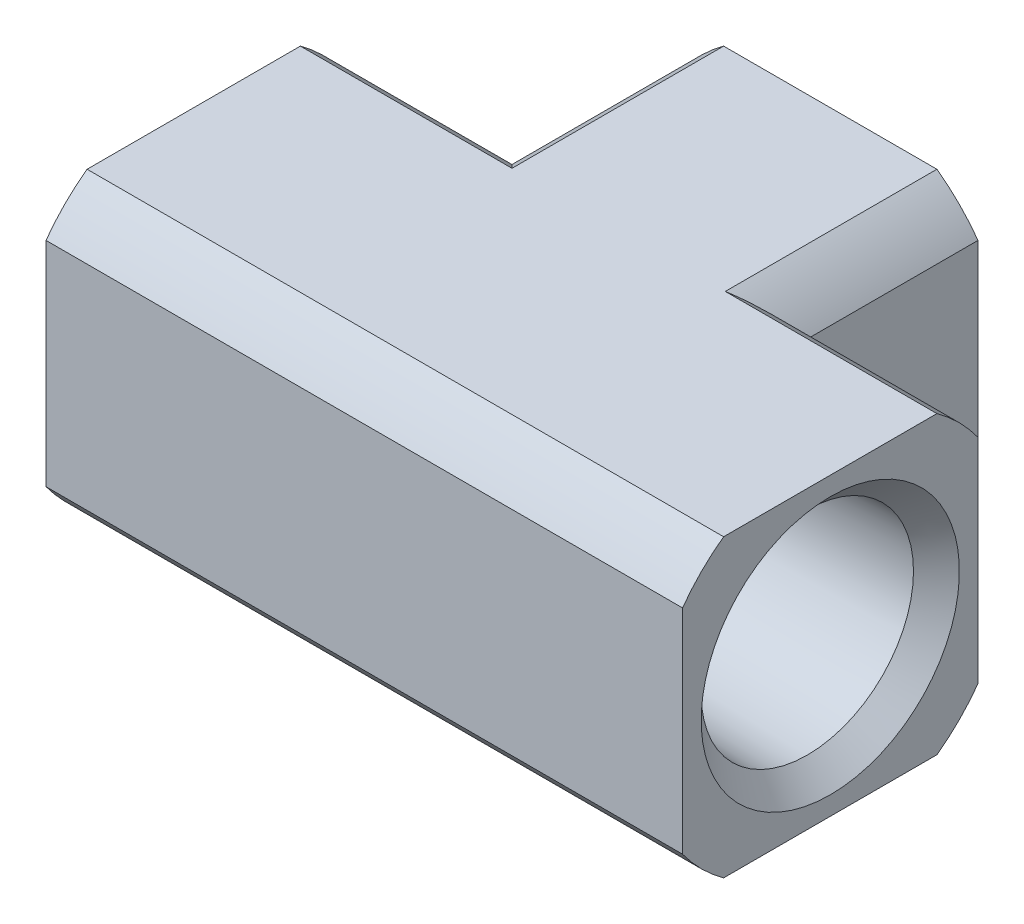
ISO-10303-21;
HEADER;
FILE_DESCRIPTION(('STEP AP214'),'2;1');
FILE_NAME('part.step','',(''),(''),'','','');
FILE_SCHEMA(('AUTOMOTIVE_DESIGN { 1 0 10303 214 1 1 1 1 }'));
ENDSEC;
DATA;
#1=APPLICATION_CONTEXT('core data for automotive mechanical design processes');
#2=APPLICATION_PROTOCOL_DEFINITION('international standard','automotive_design',2000,#1);
#3=PRODUCT_CONTEXT('',#1,'mechanical');
#4=PRODUCT('Part','Part','',(#3));
#5=PRODUCT_RELATED_PRODUCT_CATEGORY('part','',(#4));
#6=PRODUCT_DEFINITION_FORMATION('','',#4);
#7=PRODUCT_DEFINITION_CONTEXT('part definition',#1,'design');
#8=PRODUCT_DEFINITION('design','',#6,#7);
#9=PRODUCT_DEFINITION_SHAPE('','',#8);
#10=(LENGTH_UNIT() NAMED_UNIT(*) SI_UNIT(.MILLI.,.METRE.));
#11=(NAMED_UNIT(*) PLANE_ANGLE_UNIT() SI_UNIT($,.RADIAN.));
#12=(NAMED_UNIT(*) SI_UNIT($,.STERADIAN.) SOLID_ANGLE_UNIT());
#13=UNCERTAINTY_MEASURE_WITH_UNIT(LENGTH_MEASURE(1.E-05),#10,'distance_accuracy_value','');
#14=(GEOMETRIC_REPRESENTATION_CONTEXT(3) GLOBAL_UNCERTAINTY_ASSIGNED_CONTEXT((#13)) GLOBAL_UNIT_ASSIGNED_CONTEXT((#10,
#11,#12)) REPRESENTATION_CONTEXT('',''));
#15=CARTESIAN_POINT('',(0.,0.,0.));
#16=DIRECTION('',(0.,0.,1.));
#17=DIRECTION('',(1.,0.,0.));
#18=AXIS2_PLACEMENT_3D('',#15,#16,#17);
#19=CARTESIAN_POINT('',(3.81,0.,0.));
#20=DIRECTION('',(-1.,0.,0.));
#21=DIRECTION('',(0.,0.,1.));
#22=AXIS2_PLACEMENT_3D('',#19,#20,#21);
#23=CYLINDRICAL_SURFACE('',#22,4.1656);
#24=CARTESIAN_POINT('',(3.81,0.,0.));
#25=DIRECTION('',(-1.,0.,0.));
#26=DIRECTION('',(0.,0.,1.));
#27=AXIS2_PLACEMENT_3D('',#24,#25,#26);
#28=CIRCLE('',#27,4.1656);
#29=CARTESIAN_POINT('',(3.81,1.68407938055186,-3.81));
#30=VERTEX_POINT('',#29);
#31=CARTESIAN_POINT('',(3.81,-1.68407938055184,-3.81));
#32=VERTEX_POINT('',#31);
#33=EDGE_CURVE('E166',#30,#32,#28,.F.);
#34=ORIENTED_EDGE('',*,*,#33,.T.);
#35=CARTESIAN_POINT('',(0.,0.,0.));
#36=DIRECTION('',(-0.707106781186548,0.,-0.707106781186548));
#37=DIRECTION('',(-0.707106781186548,0.,0.707106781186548));
#38=AXIS2_PLACEMENT_3D('',#35,#36,#37);
#39=ELLIPSE('',#38,5.89104801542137,4.1656);
#40=CARTESIAN_POINT('',(0.,-4.1656,0.));
#41=VERTEX_POINT('',#40);
#42=EDGE_CURVE('E197',#32,#41,#39,.T.);
#43=ORIENTED_EDGE('',*,*,#42,.T.);
#44=CARTESIAN_POINT('',(0.,0.,0.));
#45=DIRECTION('',(-0.707106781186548,0.,0.707106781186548));
#46=DIRECTION('',(-0.707106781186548,0.,-0.707106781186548));
#47=AXIS2_PLACEMENT_3D('',#44,#45,#46);
#48=ELLIPSE('',#47,5.89104801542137,4.1656);
#49=CARTESIAN_POINT('',(-3.81,-1.68407938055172,-3.81));
#50=VERTEX_POINT('',#49);
#51=EDGE_CURVE('E161',#41,#50,#48,.F.);
#52=ORIENTED_EDGE('',*,*,#51,.T.);
#53=CARTESIAN_POINT('',(-3.81,0.,0.));
#54=DIRECTION('',(-1.,0.,0.));
#55=DIRECTION('',(0.,0.,1.));
#56=AXIS2_PLACEMENT_3D('',#53,#54,#55);
#57=CIRCLE('',#56,4.1656);
#58=CARTESIAN_POINT('',(-3.81,1.68407938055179,-3.81));
#59=VERTEX_POINT('',#58);
#60=EDGE_CURVE('E157',#50,#59,#57,.T.);
#61=ORIENTED_EDGE('',*,*,#60,.T.);
#62=CARTESIAN_POINT('',(0.,0.,0.));
#63=DIRECTION('',(-0.707106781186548,0.,0.707106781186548));
#64=DIRECTION('',(-0.707106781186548,0.,-0.707106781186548));
#65=AXIS2_PLACEMENT_3D('',#62,#63,#64);
#66=ELLIPSE('',#65,5.89104801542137,4.1656);
#67=CARTESIAN_POINT('',(0.,4.1656,0.));
#68=VERTEX_POINT('',#67);
#69=EDGE_CURVE('E20',#59,#68,#66,.F.);
#70=ORIENTED_EDGE('',*,*,#69,.T.);
#71=CARTESIAN_POINT('',(0.,0.,0.));
#72=DIRECTION('',(-0.707106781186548,0.,-0.707106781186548));
#73=DIRECTION('',(-0.707106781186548,0.,0.707106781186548));
#74=AXIS2_PLACEMENT_3D('',#71,#72,#73);
#75=ELLIPSE('',#74,5.89104801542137,4.1656);
#76=EDGE_CURVE('E175',#68,#30,#75,.T.);
#77=ORIENTED_EDGE('',*,*,#76,.T.);
#78=EDGE_LOOP('',(#34,#43,#52,#61,#70,#77));
#79=FACE_BOUND('',#78,.T.);
#80=ADVANCED_FACE('F16',(#79),#23,.F.);
#81=CARTESIAN_POINT('',(0.,0.,-3.81));
#82=DIRECTION('',(0.,0.,1.));
#83=DIRECTION('',(1.,0.,0.));
#84=AXIS2_PLACEMENT_3D('',#81,#82,#83);
#85=CYLINDRICAL_SURFACE('',#84,4.1656);
#86=ORIENTED_EDGE('',*,*,#76,.F.);
#87=ORIENTED_EDGE('',*,*,#69,.F.);
#88=CARTESIAN_POINT('',(0.,0.,-3.81));
#89=DIRECTION('',(0.,0.,1.));
#90=DIRECTION('',(1.,0.,0.));
#91=AXIS2_PLACEMENT_3D('',#88,#89,#90);
#92=CIRCLE('',#91,4.1656);
#93=EDGE_CURVE('E173',#59,#30,#92,.F.);
#94=ORIENTED_EDGE('',*,*,#93,.T.);
#95=EDGE_LOOP('',(#86,#87,#94));
#96=FACE_BOUND('',#95,.T.);
#97=ADVANCED_FACE('F171',(#96),#85,.F.);
#98=CARTESIAN_POINT('',(0.,0.,-3.81));
#99=DIRECTION('',(0.,0.,1.));
#100=DIRECTION('',(1.,0.,0.));
#101=AXIS2_PLACEMENT_3D('',#98,#99,#100);
#102=CYLINDRICAL_SURFACE('',#101,4.1656);
#103=ORIENTED_EDGE('',*,*,#51,.F.);
#104=ORIENTED_EDGE('',*,*,#42,.F.);
#105=CARTESIAN_POINT('',(0.,0.,-3.81));
#106=DIRECTION('',(0.,0.,1.));
#107=DIRECTION('',(1.,0.,0.));
#108=AXIS2_PLACEMENT_3D('',#105,#106,#107);
#109=CIRCLE('',#108,4.1656);
#110=EDGE_CURVE('E193',#32,#50,#109,.F.);
#111=ORIENTED_EDGE('',*,*,#110,.T.);
#112=EDGE_LOOP('',(#103,#104,#111));
#113=FACE_BOUND('',#112,.T.);
#114=ADVANCED_FACE('F212',(#113),#102,.F.);
#115=CARTESIAN_POINT('',(-3.81,0.,0.));
#116=DIRECTION('',(1.,0.,0.));
#117=DIRECTION('',(0.,0.,-1.));
#118=AXIS2_PLACEMENT_3D('',#115,#116,#117);
#119=PLANE('',#118);
#120=DIRECTION('',(0.,-1.,0.));
#121=VECTOR('',#120,1.);
#122=CARTESIAN_POINT('',(-3.81000000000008,-3.00779579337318,-3.81));
#123=LINE('',#122,#121);
#124=CARTESIAN_POINT('',(-3.81000000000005,-2.00487109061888,-3.81));
#125=VERTEX_POINT('',#124);
#126=EDGE_CURVE('E215',#50,#125,#123,.T.);
#127=ORIENTED_EDGE('',*,*,#126,.T.);
#128=CARTESIAN_POINT('',(-3.81,0.,0.));
#129=DIRECTION('',(1.,0.,0.));
#130=DIRECTION('',(0.,0.,-1.));
#131=AXIS2_PLACEMENT_3D('',#128,#129,#130);
#132=CIRCLE('',#131,4.3053);
#133=CARTESIAN_POINT('',(-3.81,2.00487109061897,-3.81));
#134=VERTEX_POINT('',#133);
#135=EDGE_CURVE('E179',#125,#134,#132,.F.);
#136=ORIENTED_EDGE('',*,*,#135,.T.);
#137=DIRECTION('',(0.,-1.,0.));
#138=VECTOR('',#137,1.);
#139=CARTESIAN_POINT('',(-3.81,3.00779579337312,-3.81));
#140=LINE('',#139,#138);
#141=EDGE_CURVE('E177',#134,#59,#140,.T.);
#142=ORIENTED_EDGE('',*,*,#141,.T.);
#143=ORIENTED_EDGE('',*,*,#60,.F.);
#144=EDGE_LOOP('',(#127,#136,#142,#143));
#145=FACE_BOUND('',#144,.T.);
#146=ADVANCED_FACE('F178',(#145),#119,.F.);
#147=CARTESIAN_POINT('',(3.81,-4.30529999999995,4.38645300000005));
#148=DIRECTION('',(-1.,0.,0.));
#149=DIRECTION('',(0.,1.,0.));
#150=AXIS2_PLACEMENT_3D('',#147,#148,#149);
#151=PLANE('',#150);
#152=ORIENTED_EDGE('',*,*,#33,.F.);
#153=DIRECTION('',(0.,1.,0.));
#154=VECTOR('',#153,1.);
#155=CARTESIAN_POINT('',(3.81,3.00779579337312,-3.81));
#156=LINE('',#155,#154);
#157=CARTESIAN_POINT('',(3.81000000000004,2.00487109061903,-3.80999999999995));
#158=VERTEX_POINT('',#157);
#159=EDGE_CURVE('E185',#30,#158,#156,.T.);
#160=ORIENTED_EDGE('',*,*,#159,.T.);
#161=CARTESIAN_POINT('',(3.81,0.,0.));
#162=DIRECTION('',(-1.,0.,0.));
#163=DIRECTION('',(0.,-1.,0.));
#164=AXIS2_PLACEMENT_3D('',#161,#162,#163);
#165=CIRCLE('',#164,4.3053);
#166=CARTESIAN_POINT('',(3.81,-2.00487109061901,-3.81));
#167=VERTEX_POINT('',#166);
#168=EDGE_CURVE('E204',#158,#167,#165,.F.);
#169=ORIENTED_EDGE('',*,*,#168,.T.);
#170=DIRECTION('',(0.,1.,0.));
#171=VECTOR('',#170,1.);
#172=CARTESIAN_POINT('',(3.81,-3.00779579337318,-3.81));
#173=LINE('',#172,#171);
#174=EDGE_CURVE('E184',#167,#32,#173,.T.);
#175=ORIENTED_EDGE('',*,*,#174,.T.);
#176=EDGE_LOOP('',(#152,#160,#169,#175));
#177=FACE_BOUND('',#176,.T.);
#178=ADVANCED_FACE('F202',(#177),#151,.F.);
#179=CARTESIAN_POINT('',(3.81,4.33151220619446,-3.81));
#180=DIRECTION('',(0.,0.,1.));
#181=DIRECTION('',(-1.,0.,0.));
#182=AXIS2_PLACEMENT_3D('',#179,#180,#181);
#183=PLANE('',#182);
#184=CARTESIAN_POINT('',(0.,0.,-3.81));
#185=DIRECTION('',(0.,0.,1.));
#186=DIRECTION('',(1.,0.,0.));
#187=AXIS2_PLACEMENT_3D('',#184,#185,#186);
#188=CIRCLE('',#187,4.3053);
#189=EDGE_CURVE('E294',#134,#158,#188,.F.);
#190=ORIENTED_EDGE('',*,*,#189,.T.);
#191=ORIENTED_EDGE('',*,*,#159,.F.);
#192=ORIENTED_EDGE('',*,*,#93,.F.);
#193=ORIENTED_EDGE('',*,*,#141,.F.);
#194=EDGE_LOOP('',(#190,#191,#192,#193));
#195=FACE_BOUND('',#194,.T.);
#196=ADVANCED_FACE('F187',(#195),#183,.F.);
#197=CARTESIAN_POINT('',(3.81,-1.68407938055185,-3.81));
#198=DIRECTION('',(0.,0.,1.));
#199=DIRECTION('',(-1.,0.,0.));
#200=AXIS2_PLACEMENT_3D('',#197,#198,#199);
#201=PLANE('',#200);
#202=ORIENTED_EDGE('',*,*,#110,.F.);
#203=ORIENTED_EDGE('',*,*,#174,.F.);
#204=CARTESIAN_POINT('',(0.,0.,-3.81));
#205=DIRECTION('',(0.,0.,1.));
#206=DIRECTION('',(1.,0.,0.));
#207=AXIS2_PLACEMENT_3D('',#204,#205,#206);
#208=CIRCLE('',#207,4.3053);
#209=EDGE_CURVE('E290',#167,#125,#208,.F.);
#210=ORIENTED_EDGE('',*,*,#209,.T.);
#211=ORIENTED_EDGE('',*,*,#126,.F.);
#212=EDGE_LOOP('',(#202,#203,#210,#211));
#213=FACE_BOUND('',#212,.T.);
#214=ADVANCED_FACE('F214',(#213),#201,.F.);
#215=CARTESIAN_POINT('',(-8.636,0.,0.));
#216=DIRECTION('',(1.,0.,0.));
#217=DIRECTION('',(0.,0.,-1.));
#218=AXIS2_PLACEMENT_3D('',#215,#216,#217);
#219=CYLINDRICAL_SURFACE('',#218,4.3053);
#220=ORIENTED_EDGE('',*,*,#135,.F.);
#221=CARTESIAN_POINT('',(0.,0.,0.));
#222=DIRECTION('',(0.707106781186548,0.,-0.707106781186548));
#223=DIRECTION('',(0.707106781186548,0.,0.707106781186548));
#224=AXIS2_PLACEMENT_3D('',#221,#222,#223);
#225=ELLIPSE('',#224,6.08861365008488,4.3053);
#226=EDGE_CURVE('E288',#125,#134,#225,.T.);
#227=ORIENTED_EDGE('',*,*,#226,.T.);
#228=EDGE_LOOP('',(#220,#227));
#229=FACE_BOUND('',#228,.T.);
#230=CARTESIAN_POINT('',(-6.54466311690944,0.,0.));
#231=DIRECTION('',(-1.,0.,0.));
#232=DIRECTION('',(0.,-1.,0.));
#233=AXIS2_PLACEMENT_3D('',#230,#231,#232);
#234=CIRCLE('',#233,4.3053);
#235=CARTESIAN_POINT('',(-6.54466311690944,-4.3053,0.));
#236=VERTEX_POINT('',#235);
#237=EDGE_CURVE('E218',#236,#236,#234,.T.);
#238=ORIENTED_EDGE('',*,*,#237,.T.);
#239=EDGE_LOOP('',(#238));
#240=FACE_BOUND('',#239,.T.);
#241=ADVANCED_FACE('F304',(#229,#240),#219,.F.);
#242=CARTESIAN_POINT('',(6.54466311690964,0.,0.));
#243=DIRECTION('',(-1.,0.,0.));
#244=DIRECTION('',(0.,-1.,0.));
#245=AXIS2_PLACEMENT_3D('',#242,#243,#244);
#246=CYLINDRICAL_SURFACE('',#245,4.3053);
#247=CARTESIAN_POINT('',(0.,0.,0.));
#248=DIRECTION('',(-0.707106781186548,0.,-0.707106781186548));
#249=DIRECTION('',(-0.707106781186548,0.,0.707106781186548));
#250=AXIS2_PLACEMENT_3D('',#247,#248,#249);
#251=ELLIPSE('',#250,6.08861365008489,4.3053);
#252=EDGE_CURVE('E292',#158,#167,#251,.T.);
#253=ORIENTED_EDGE('',*,*,#252,.T.);
#254=ORIENTED_EDGE('',*,*,#168,.F.);
#255=EDGE_LOOP('',(#253,#254));
#256=FACE_BOUND('',#255,.T.);
#257=CARTESIAN_POINT('',(6.54466311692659,0.,0.));
#258=DIRECTION('',(1.,0.,0.));
#259=DIRECTION('',(0.,0.,1.));
#260=AXIS2_PLACEMENT_3D('',#257,#258,#259);
#261=CIRCLE('',#260,4.30530000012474);
#262=CARTESIAN_POINT('',(6.54466311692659,0.,4.30530000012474));
#263=VERTEX_POINT('',#262);
#264=EDGE_CURVE('E311',#263,#263,#261,.T.);
#265=ORIENTED_EDGE('',*,*,#264,.T.);
#266=EDGE_LOOP('',(#265));
#267=FACE_BOUND('',#266,.T.);
#268=ADVANCED_FACE('F299',(#256,#267),#246,.F.);
#269=CARTESIAN_POINT('',(0.,0.,-6.53796));
#270=DIRECTION('',(0.,0.,1.));
#271=DIRECTION('',(1.,0.,0.));
#272=AXIS2_PLACEMENT_3D('',#269,#270,#271);
#273=CYLINDRICAL_SURFACE('',#272,4.3053);
#274=ORIENTED_EDGE('',*,*,#252,.F.);
#275=ORIENTED_EDGE('',*,*,#189,.F.);
#276=ORIENTED_EDGE('',*,*,#226,.F.);
#277=ORIENTED_EDGE('',*,*,#209,.F.);
#278=EDGE_LOOP('',(#274,#275,#276,#277));
#279=FACE_BOUND('',#278,.T.);
#280=CARTESIAN_POINT('',(0.,0.,-6.53796000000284));
#281=DIRECTION('',(0.,0.,-1.));
#282=DIRECTION('',(0.,-1.,0.));
#283=AXIS2_PLACEMENT_3D('',#280,#281,#282);
#284=CIRCLE('',#283,4.30530000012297);
#285=CARTESIAN_POINT('',(0.,-4.30530000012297,-6.53796000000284));
#286=VERTEX_POINT('',#285);
#287=EDGE_CURVE('E313',#286,#286,#284,.T.);
#288=ORIENTED_EDGE('',*,*,#287,.T.);
#289=EDGE_LOOP('',(#288));
#290=FACE_BOUND('',#289,.T.);
#291=ADVANCED_FACE('F301',(#279,#290),#273,.F.);
#292=CARTESIAN_POINT('',(-6.54466311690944,0.,0.));
#293=DIRECTION('',(-1.,0.,0.));
#294=DIRECTION('',(0.,-1.,0.));
#295=AXIS2_PLACEMENT_3D('',#292,#293,#294);
#296=CONICAL_SURFACE('',#295,4.3053,0.0311192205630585);
#297=ORIENTED_EDGE('',*,*,#237,.F.);
#298=EDGE_LOOP('',(#297));
#299=FACE_BOUND('',#298,.T.);
#300=CARTESIAN_POINT('',(-12.4914181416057,0.,0.));
#301=DIRECTION('',(-1.,0.,0.));
#302=DIRECTION('',(0.,0.,1.));
#303=AXIS2_PLACEMENT_3D('',#300,#301,#302);
#304=CIRCLE('',#303,4.49041814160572);
#305=CARTESIAN_POINT('',(-12.4914181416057,0.,4.49041814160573));
#306=VERTEX_POINT('',#305);
#307=EDGE_CURVE('E319',#306,#306,#304,.T.);
#308=ORIENTED_EDGE('',*,*,#307,.T.);
#309=EDGE_LOOP('',(#308));
#310=FACE_BOUND('',#309,.T.);
#311=ADVANCED_FACE('F646',(#299,#310),#296,.F.);
#312=CARTESIAN_POINT('',(12.4914181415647,0.,0.));
#313=DIRECTION('',(1.,0.,0.));
#314=DIRECTION('',(0.,0.,-1.));
#315=AXIS2_PLACEMENT_3D('',#312,#313,#314);
#316=CONICAL_SURFACE('',#315,4.49041814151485,0.0311192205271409);
#317=CARTESIAN_POINT('',(12.4914181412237,0.,0.));
#318=DIRECTION('',(1.,0.,0.));
#319=DIRECTION('',(0.,0.,1.));
#320=AXIS2_PLACEMENT_3D('',#317,#318,#319);
#321=CIRCLE('',#320,4.49041814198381);
#322=CARTESIAN_POINT('',(12.4914181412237,0.,4.49041814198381));
#323=VERTEX_POINT('',#322);
#324=EDGE_CURVE('E323',#323,#323,#321,.T.);
#325=ORIENTED_EDGE('',*,*,#324,.T.);
#326=EDGE_LOOP('',(#325));
#327=FACE_BOUND('',#326,.T.);
#328=ORIENTED_EDGE('',*,*,#264,.F.);
#329=EDGE_LOOP('',(#328));
#330=FACE_BOUND('',#329,.T.);
#331=ADVANCED_FACE('F654',(#327,#330),#316,.F.);
#332=CARTESIAN_POINT('',(0.,0.,-12.4916335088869));
#333=DIRECTION('',(0.,0.,-1.));
#334=DIRECTION('',(0.,1.,0.));
#335=AXIS2_PLACEMENT_3D('',#332,#333,#334);
#336=CONICAL_SURFACE('',#335,4.49063350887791,0.0311192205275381);
#337=ORIENTED_EDGE('',*,*,#287,.F.);
#338=EDGE_LOOP('',(#337));
#339=FACE_BOUND('',#338,.T.);
#340=CARTESIAN_POINT('',(0.,0.,-12.4916335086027));
#341=DIRECTION('',(0.,0.,-1.));
#342=DIRECTION('',(0.,-1.,0.));
#343=AXIS2_PLACEMENT_3D('',#340,#341,#342);
#344=CIRCLE('',#343,4.49063350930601);
#345=CARTESIAN_POINT('',(0.,-4.49063350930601,-12.4916335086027));
#346=VERTEX_POINT('',#345);
#347=EDGE_CURVE('E326',#346,#346,#344,.T.);
#348=ORIENTED_EDGE('',*,*,#347,.T.);
#349=EDGE_LOOP('',(#348));
#350=FACE_BOUND('',#349,.T.);
#351=ADVANCED_FACE('F661',(#339,#350),#336,.F.);
#352=CARTESIAN_POINT('',(0.,0.,0.));
#353=DIRECTION('',(1.,0.,0.));
#354=DIRECTION('',(0.,0.,-1.));
#355=AXIS2_PLACEMENT_3D('',#352,#353,#354);
#356=CYLINDRICAL_SURFACE('',#355,7.70636);
#357=CARTESIAN_POINT('',(-13.462,0.,0.));
#358=DIRECTION('',(1.,0.,0.));
#359=DIRECTION('',(0.,0.,-1.));
#360=AXIS2_PLACEMENT_3D('',#357,#358,#359);
#361=CIRCLE('',#360,7.70636);
#362=CARTESIAN_POINT('',(-13.462,-6.2484,-4.51059662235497));
#363=VERTEX_POINT('',#362);
#364=CARTESIAN_POINT('',(-13.462,-4.51059662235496,-6.2484));
#365=VERTEX_POINT('',#364);
#366=EDGE_CURVE('E275',#363,#365,#361,.T.);
#367=ORIENTED_EDGE('',*,*,#366,.T.);
#368=DIRECTION('',(-1.,0.,0.));
#369=VECTOR('',#368,1.);
#370=CARTESIAN_POINT('',(0.,-4.51059662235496,-6.2484));
#371=LINE('',#370,#369);
#372=CARTESIAN_POINT('',(-6.2484,-4.51059662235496,-6.2484));
#373=VERTEX_POINT('',#372);
#374=EDGE_CURVE('E316',#373,#365,#371,.T.);
#375=ORIENTED_EDGE('',*,*,#374,.F.);
#376=CARTESIAN_POINT('',(0.,0.,0.));
#377=DIRECTION('',(0.707106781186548,0.,-0.707106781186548));
#378=DIRECTION('',(0.707106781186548,0.,0.707106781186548));
#379=AXIS2_PLACEMENT_3D('',#376,#377,#378);
#380=ELLIPSE('',#379,10.8984388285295,7.70636);
#381=CARTESIAN_POINT('',(-4.51059662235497,-6.2484,-4.51059662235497));
#382=VERTEX_POINT('',#381);
#383=EDGE_CURVE('E283',#382,#373,#380,.T.);
#384=ORIENTED_EDGE('',*,*,#383,.F.);
#385=DIRECTION('',(1.,0.,0.));
#386=VECTOR('',#385,1.);
#387=CARTESIAN_POINT('',(0.,-6.2484,-4.51059662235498));
#388=LINE('',#387,#386);
#389=EDGE_CURVE('E331',#363,#382,#388,.T.);
#390=ORIENTED_EDGE('',*,*,#389,.F.);
#391=EDGE_LOOP('',(#367,#375,#384,#390));
#392=FACE_BOUND('',#391,.T.);
#393=ADVANCED_FACE('F414',(#392),#356,.T.);
#394=CARTESIAN_POINT('',(0.,4.51059662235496,-6.2484));
#395=DIRECTION('',(0.,0.,-1.));
#396=DIRECTION('',(-1.,0.,0.));
#397=AXIS2_PLACEMENT_3D('',#394,#395,#396);
#398=PLANE('',#397);
#399=DIRECTION('',(0.,1.,0.));
#400=VECTOR('',#399,1.);
#401=CARTESIAN_POINT('',(-13.462,0.,-6.2484));
#402=LINE('',#401,#400);
#403=CARTESIAN_POINT('',(-13.462,4.51059662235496,-6.2484));
#404=VERTEX_POINT('',#403);
#405=EDGE_CURVE('E274',#365,#404,#402,.T.);
#406=ORIENTED_EDGE('',*,*,#405,.T.);
#407=DIRECTION('',(1.,0.,0.));
#408=VECTOR('',#407,1.);
#409=CARTESIAN_POINT('',(0.,4.51059662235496,-6.2484));
#410=LINE('',#409,#408);
#411=CARTESIAN_POINT('',(-6.2484,4.51059662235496,-6.2484));
#412=VERTEX_POINT('',#411);
#413=EDGE_CURVE('E350',#412,#404,#410,.F.);
#414=ORIENTED_EDGE('',*,*,#413,.F.);
#415=DIRECTION('',(0.,1.,0.));
#416=VECTOR('',#415,1.);
#417=CARTESIAN_POINT('',(-6.2484,4.51059662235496,-6.2484));
#418=LINE('',#417,#416);
#419=EDGE_CURVE('E329',#373,#412,#418,.T.);
#420=ORIENTED_EDGE('',*,*,#419,.F.);
#421=ORIENTED_EDGE('',*,*,#374,.T.);
#422=EDGE_LOOP('',(#406,#414,#420,#421));
#423=FACE_BOUND('',#422,.T.);
#424=ADVANCED_FACE('F408',(#423),#398,.T.);
#425=CARTESIAN_POINT('',(-12.4914181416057,0.,0.));
#426=DIRECTION('',(-1.,0.,0.));
#427=DIRECTION('',(0.,0.,1.));
#428=AXIS2_PLACEMENT_3D('',#425,#426,#427);
#429=CONICAL_SURFACE('',#428,4.49041814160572,0.785398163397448);
#430=ORIENTED_EDGE('',*,*,#307,.F.);
#431=EDGE_LOOP('',(#430));
#432=FACE_BOUND('',#431,.T.);
#433=CARTESIAN_POINT('',(-13.462,0.,0.));
#434=DIRECTION('',(-1.,0.,0.));
#435=DIRECTION('',(0.,0.,1.));
#436=AXIS2_PLACEMENT_3D('',#433,#434,#435);
#437=CIRCLE('',#436,5.461);
#438=CARTESIAN_POINT('',(-13.462,0.,5.461));
#439=VERTEX_POINT('',#438);
#440=EDGE_CURVE('E265',#439,#439,#437,.T.);
#441=ORIENTED_EDGE('',*,*,#440,.T.);
#442=EDGE_LOOP('',(#441));
#443=FACE_BOUND('',#442,.T.);
#444=ADVANCED_FACE('F18',(#432,#443),#429,.F.);
#445=CARTESIAN_POINT('',(0.,-4.51059662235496,6.2484));
#446=DIRECTION('',(0.,0.,1.));
#447=DIRECTION('',(1.,0.,0.));
#448=AXIS2_PLACEMENT_3D('',#445,#446,#447);
#449=PLANE('',#448);
#450=DIRECTION('',(0.,1.,0.));
#451=VECTOR('',#450,1.);
#452=CARTESIAN_POINT('',(-13.462,0.,6.2484));
#453=LINE('',#452,#451);
#454=CARTESIAN_POINT('',(-13.462,4.51059662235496,6.2484));
#455=VERTEX_POINT('',#454);
#456=CARTESIAN_POINT('',(-13.462,-4.51059662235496,6.2484));
#457=VERTEX_POINT('',#456);
#458=EDGE_CURVE('E271',#455,#457,#453,.F.);
#459=ORIENTED_EDGE('',*,*,#458,.T.);
#460=DIRECTION('',(1.,0.,0.));
#461=VECTOR('',#460,1.);
#462=CARTESIAN_POINT('',(0.,-4.51059662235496,6.2484));
#463=LINE('',#462,#461);
#464=CARTESIAN_POINT('',(13.462,-4.51059662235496,6.2484));
#465=VERTEX_POINT('',#464);
#466=EDGE_CURVE('E322',#465,#457,#463,.F.);
#467=ORIENTED_EDGE('',*,*,#466,.F.);
#468=DIRECTION('',(0.,1.,0.));
#469=VECTOR('',#468,1.);
#470=CARTESIAN_POINT('',(13.462,0.,6.2484));
#471=LINE('',#470,#469);
#472=CARTESIAN_POINT('',(13.462,4.51059662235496,6.2484));
#473=VERTEX_POINT('',#472);
#474=EDGE_CURVE('E257',#473,#465,#471,.F.);
#475=ORIENTED_EDGE('',*,*,#474,.F.);
#476=DIRECTION('',(1.,0.,0.));
#477=VECTOR('',#476,1.);
#478=CARTESIAN_POINT('',(0.,4.51059662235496,6.2484));
#479=LINE('',#478,#477);
#480=EDGE_CURVE('E261',#455,#473,#479,.T.);
#481=ORIENTED_EDGE('',*,*,#480,.F.);
#482=EDGE_LOOP('',(#459,#467,#475,#481));
#483=FACE_BOUND('',#482,.T.);
#484=ADVANCED_FACE('F451',(#483),#449,.T.);
#485=CARTESIAN_POINT('',(0.,0.,0.));
#486=DIRECTION('',(1.,0.,0.));
#487=DIRECTION('',(0.,0.,-1.));
#488=AXIS2_PLACEMENT_3D('',#485,#486,#487);
#489=CYLINDRICAL_SURFACE('',#488,7.70636);
#490=CARTESIAN_POINT('',(-13.462,0.,0.));
#491=DIRECTION('',(1.,0.,0.));
#492=DIRECTION('',(0.,0.,-1.));
#493=AXIS2_PLACEMENT_3D('',#490,#491,#492);
#494=CIRCLE('',#493,7.70636);
#495=CARTESIAN_POINT('',(-13.462,-6.2484,4.51059662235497));
#496=VERTEX_POINT('',#495);
#497=EDGE_CURVE('E268',#457,#496,#494,.T.);
#498=ORIENTED_EDGE('',*,*,#497,.T.);
#499=DIRECTION('',(1.,0.,0.));
#500=VECTOR('',#499,1.);
#501=CARTESIAN_POINT('',(0.,-6.2484,4.51059662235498));
#502=LINE('',#501,#500);
#503=CARTESIAN_POINT('',(13.462,-6.2484,4.51059662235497));
#504=VERTEX_POINT('',#503);
#505=EDGE_CURVE('E334',#504,#496,#502,.F.);
#506=ORIENTED_EDGE('',*,*,#505,.F.);
#507=CARTESIAN_POINT('',(13.462,0.,0.));
#508=DIRECTION('',(1.,0.,0.));
#509=DIRECTION('',(0.,0.,-1.));
#510=AXIS2_PLACEMENT_3D('',#507,#508,#509);
#511=CIRCLE('',#510,7.70636);
#512=EDGE_CURVE('E254',#465,#504,#511,.T.);
#513=ORIENTED_EDGE('',*,*,#512,.F.);
#514=ORIENTED_EDGE('',*,*,#466,.T.);
#515=EDGE_LOOP('',(#498,#506,#513,#514));
#516=FACE_BOUND('',#515,.T.);
#517=ADVANCED_FACE('F446',(#516),#489,.T.);
#518=CARTESIAN_POINT('',(0.,0.,0.));
#519=DIRECTION('',(1.,0.,0.));
#520=DIRECTION('',(0.,0.,-1.));
#521=AXIS2_PLACEMENT_3D('',#518,#519,#520);
#522=CYLINDRICAL_SURFACE('',#521,7.70636);
#523=CARTESIAN_POINT('',(13.462,0.,0.));
#524=DIRECTION('',(1.,0.,0.));
#525=DIRECTION('',(0.,0.,-1.));
#526=AXIS2_PLACEMENT_3D('',#523,#524,#525);
#527=CIRCLE('',#526,7.70636);
#528=CARTESIAN_POINT('',(13.462,-6.2484,-4.51059662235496));
#529=VERTEX_POINT('',#528);
#530=CARTESIAN_POINT('',(13.462,-4.51059662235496,-6.2484));
#531=VERTEX_POINT('',#530);
#532=EDGE_CURVE('E250',#529,#531,#527,.T.);
#533=ORIENTED_EDGE('',*,*,#532,.F.);
#534=DIRECTION('',(1.,0.,0.));
#535=VECTOR('',#534,1.);
#536=CARTESIAN_POINT('',(0.,-6.2484,-4.51059662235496));
#537=LINE('',#536,#535);
#538=CARTESIAN_POINT('',(4.51059662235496,-6.2484,-4.51059662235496));
#539=VERTEX_POINT('',#538);
#540=EDGE_CURVE('E286',#539,#529,#537,.T.);
#541=ORIENTED_EDGE('',*,*,#540,.F.);
#542=CARTESIAN_POINT('',(0.,0.,0.));
#543=DIRECTION('',(0.707106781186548,0.,0.707106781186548));
#544=DIRECTION('',(0.707106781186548,0.,-0.707106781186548));
#545=AXIS2_PLACEMENT_3D('',#542,#543,#544);
#546=ELLIPSE('',#545,10.8984388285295,7.70636);
#547=CARTESIAN_POINT('',(6.2484,-4.51059662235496,-6.2484));
#548=VERTEX_POINT('',#547);
#549=EDGE_CURVE('E278',#548,#539,#546,.F.);
#550=ORIENTED_EDGE('',*,*,#549,.F.);
#551=DIRECTION('',(-1.,0.,0.));
#552=VECTOR('',#551,1.);
#553=CARTESIAN_POINT('',(0.,-4.51059662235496,-6.2484));
#554=LINE('',#553,#552);
#555=EDGE_CURVE('E287',#531,#548,#554,.T.);
#556=ORIENTED_EDGE('',*,*,#555,.F.);
#557=EDGE_LOOP('',(#533,#541,#550,#556));
#558=FACE_BOUND('',#557,.T.);
#559=ADVANCED_FACE('F466',(#558),#522,.T.);
#560=CARTESIAN_POINT('',(13.462000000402,0.,0.));
#561=DIRECTION('',(1.,0.,0.));
#562=DIRECTION('',(0.,1.,0.));
#563=AXIS2_PLACEMENT_3D('',#560,#561,#562);
#564=CONICAL_SURFACE('',#563,5.46099999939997,0.785398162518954);
#565=CARTESIAN_POINT('',(13.4620000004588,0.,0.));
#566=DIRECTION('',(1.,0.,0.));
#567=DIRECTION('',(0.,1.,0.));
#568=AXIS2_PLACEMENT_3D('',#565,#566,#567);
#569=CIRCLE('',#568,5.46099999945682);
#570=CARTESIAN_POINT('',(13.4620000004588,5.46099999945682,0.));
#571=VERTEX_POINT('',#570);
#572=EDGE_CURVE('E246',#571,#571,#569,.F.);
#573=ORIENTED_EDGE('',*,*,#572,.F.);
#574=EDGE_LOOP('',(#573));
#575=FACE_BOUND('',#574,.T.);
#576=ORIENTED_EDGE('',*,*,#324,.F.);
#577=EDGE_LOOP('',(#576));
#578=FACE_BOUND('',#577,.T.);
#579=ADVANCED_FACE('F468',(#575,#578),#564,.F.);
#580=CARTESIAN_POINT('',(0.,4.51059662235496,-6.2484));
#581=DIRECTION('',(0.,0.,-1.));
#582=DIRECTION('',(-1.,0.,0.));
#583=AXIS2_PLACEMENT_3D('',#580,#581,#582);
#584=PLANE('',#583);
#585=DIRECTION('',(0.,1.,0.));
#586=VECTOR('',#585,1.);
#587=CARTESIAN_POINT('',(13.462,0.,-6.2484));
#588=LINE('',#587,#586);
#589=CARTESIAN_POINT('',(13.462,4.51059662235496,-6.2484));
#590=VERTEX_POINT('',#589);
#591=EDGE_CURVE('E249',#531,#590,#588,.T.);
#592=ORIENTED_EDGE('',*,*,#591,.F.);
#593=ORIENTED_EDGE('',*,*,#555,.T.);
#594=DIRECTION('',(0.,1.,0.));
#595=VECTOR('',#594,1.);
#596=CARTESIAN_POINT('',(6.2484,-4.51059662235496,-6.2484));
#597=LINE('',#596,#595);
#598=CARTESIAN_POINT('',(6.2484,4.51059662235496,-6.2484));
#599=VERTEX_POINT('',#598);
#600=EDGE_CURVE('E344',#599,#548,#597,.F.);
#601=ORIENTED_EDGE('',*,*,#600,.F.);
#602=DIRECTION('',(1.,0.,0.));
#603=VECTOR('',#602,1.);
#604=CARTESIAN_POINT('',(0.,4.51059662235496,-6.2484));
#605=LINE('',#604,#603);
#606=EDGE_CURVE('E242',#590,#599,#605,.F.);
#607=ORIENTED_EDGE('',*,*,#606,.F.);
#608=EDGE_LOOP('',(#592,#593,#601,#607));
#609=FACE_BOUND('',#608,.T.);
#610=ADVANCED_FACE('F463',(#609),#584,.T.);
#611=CARTESIAN_POINT('',(0.,0.,0.));
#612=DIRECTION('',(0.,0.,-1.));
#613=DIRECTION('',(-1.,0.,0.));
#614=AXIS2_PLACEMENT_3D('',#611,#612,#613);
#615=CYLINDRICAL_SURFACE('',#614,7.70636);
#616=CARTESIAN_POINT('',(0.,0.,-13.462));
#617=DIRECTION('',(0.,0.,-1.));
#618=DIRECTION('',(-1.,0.,0.));
#619=AXIS2_PLACEMENT_3D('',#616,#617,#618);
#620=CIRCLE('',#619,7.70636);
#621=CARTESIAN_POINT('',(-6.2484,-4.51059662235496,-13.462));
#622=VERTEX_POINT('',#621);
#623=CARTESIAN_POINT('',(-4.51059662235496,-6.2484,-13.462));
#624=VERTEX_POINT('',#623);
#625=EDGE_CURVE('E235',#622,#624,#620,.F.);
#626=ORIENTED_EDGE('',*,*,#625,.T.);
#627=DIRECTION('',(0.,0.,-1.));
#628=VECTOR('',#627,1.);
#629=CARTESIAN_POINT('',(-4.51059662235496,-6.2484,-4.51059662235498));
#630=LINE('',#629,#628);
#631=EDGE_CURVE('E282',#382,#624,#630,.T.);
#632=ORIENTED_EDGE('',*,*,#631,.F.);
#633=ORIENTED_EDGE('',*,*,#383,.T.);
#634=DIRECTION('',(0.,0.,1.));
#635=VECTOR('',#634,1.);
#636=CARTESIAN_POINT('',(-6.2484,-4.51059662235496,0.));
#637=LINE('',#636,#635);
#638=EDGE_CURVE('E347',#622,#373,#637,.T.);
#639=ORIENTED_EDGE('',*,*,#638,.F.);
#640=EDGE_LOOP('',(#626,#632,#633,#639));
#641=FACE_BOUND('',#640,.T.);
#642=ADVANCED_FACE('F412',(#641),#615,.T.);
#643=CARTESIAN_POINT('',(0.,-6.2484,-4.51059662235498));
#644=DIRECTION('',(0.,-1.,0.));
#645=DIRECTION('',(0.,0.,-1.));
#646=AXIS2_PLACEMENT_3D('',#643,#644,#645);
#647=PLANE('',#646);
#648=DIRECTION('',(1.,0.,0.));
#649=VECTOR('',#648,1.);
#650=CARTESIAN_POINT('',(0.,-6.2484,-13.462));
#651=LINE('',#650,#649);
#652=CARTESIAN_POINT('',(4.51059662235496,-6.2484,-13.462));
#653=VERTEX_POINT('',#652);
#654=EDGE_CURVE('E234',#624,#653,#651,.T.);
#655=ORIENTED_EDGE('',*,*,#654,.T.);
#656=DIRECTION('',(0.,0.,-1.));
#657=VECTOR('',#656,1.);
#658=CARTESIAN_POINT('',(4.51059662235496,-6.2484,0.));
#659=LINE('',#658,#657);
#660=EDGE_CURVE('E281',#539,#653,#659,.T.);
#661=ORIENTED_EDGE('',*,*,#660,.F.);
#662=ORIENTED_EDGE('',*,*,#540,.T.);
#663=DIRECTION('',(0.,0.,-1.));
#664=VECTOR('',#663,1.);
#665=CARTESIAN_POINT('',(13.462,-6.2484,0.));
#666=LINE('',#665,#664);
#667=EDGE_CURVE('E253',#504,#529,#666,.T.);
#668=ORIENTED_EDGE('',*,*,#667,.F.);
#669=ORIENTED_EDGE('',*,*,#505,.T.);
#670=DIRECTION('',(0.,0.,-1.));
#671=VECTOR('',#670,1.);
#672=CARTESIAN_POINT('',(-13.462,-6.2484,0.));
#673=LINE('',#672,#671);
#674=EDGE_CURVE('E277',#496,#363,#673,.T.);
#675=ORIENTED_EDGE('',*,*,#674,.T.);
#676=ORIENTED_EDGE('',*,*,#389,.T.);
#677=ORIENTED_EDGE('',*,*,#631,.T.);
#678=EDGE_LOOP('',(#655,#661,#662,#668,#669,#675,#676,#677));
#679=FACE_BOUND('',#678,.T.);
#680=ADVANCED_FACE('F442',(#679),#647,.T.);
#681=CARTESIAN_POINT('',(0.,0.,0.));
#682=DIRECTION('',(0.,0.,-1.));
#683=DIRECTION('',(-1.,0.,0.));
#684=AXIS2_PLACEMENT_3D('',#681,#682,#683);
#685=CYLINDRICAL_SURFACE('',#684,7.70636);
#686=CARTESIAN_POINT('',(0.,0.,-13.462));
#687=DIRECTION('',(0.,0.,-1.));
#688=DIRECTION('',(-1.,0.,0.));
#689=AXIS2_PLACEMENT_3D('',#686,#687,#688);
#690=CIRCLE('',#689,7.70636);
#691=CARTESIAN_POINT('',(6.2484,-4.51059662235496,-13.462));
#692=VERTEX_POINT('',#691);
#693=EDGE_CURVE('E232',#653,#692,#690,.F.);
#694=ORIENTED_EDGE('',*,*,#693,.T.);
#695=DIRECTION('',(0.,0.,-1.));
#696=VECTOR('',#695,1.);
#697=CARTESIAN_POINT('',(6.2484,-4.51059662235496,0.));
#698=LINE('',#697,#696);
#699=EDGE_CURVE('E330',#548,#692,#698,.T.);
#700=ORIENTED_EDGE('',*,*,#699,.F.);
#701=ORIENTED_EDGE('',*,*,#549,.T.);
#702=ORIENTED_EDGE('',*,*,#660,.T.);
#703=EDGE_LOOP('',(#694,#700,#701,#702));
#704=FACE_BOUND('',#703,.T.);
#705=ADVANCED_FACE('F438',(#704),#685,.T.);
#706=CARTESIAN_POINT('',(6.2484,-4.51059662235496,0.));
#707=DIRECTION('',(1.,0.,0.));
#708=DIRECTION('',(0.,0.,-1.));
#709=AXIS2_PLACEMENT_3D('',#706,#707,#708);
#710=PLANE('',#709);
#711=DIRECTION('',(0.,1.,0.));
#712=VECTOR('',#711,1.);
#713=CARTESIAN_POINT('',(6.2484,0.,-13.462));
#714=LINE('',#713,#712);
#715=CARTESIAN_POINT('',(6.2484,4.51059662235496,-13.462));
#716=VERTEX_POINT('',#715);
#717=EDGE_CURVE('E231',#692,#716,#714,.T.);
#718=ORIENTED_EDGE('',*,*,#717,.T.);
#719=DIRECTION('',(0.,0.,-1.));
#720=VECTOR('',#719,1.);
#721=CARTESIAN_POINT('',(6.2484,4.51059662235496,0.));
#722=LINE('',#721,#720);
#723=EDGE_CURVE('E241',#599,#716,#722,.T.);
#724=ORIENTED_EDGE('',*,*,#723,.F.);
#725=ORIENTED_EDGE('',*,*,#600,.T.);
#726=ORIENTED_EDGE('',*,*,#699,.T.);
#727=EDGE_LOOP('',(#718,#724,#725,#726));
#728=FACE_BOUND('',#727,.T.);
#729=ADVANCED_FACE('F435',(#728),#710,.T.);
#730=CARTESIAN_POINT('',(0.,0.,-13.4620000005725));
#731=DIRECTION('',(0.,0.,-1.));
#732=DIRECTION('',(-1.,0.,0.));
#733=AXIS2_PLACEMENT_3D('',#730,#731,#732);
#734=CONICAL_SURFACE('',#733,5.46099999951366,0.785398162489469);
#735=ORIENTED_EDGE('',*,*,#347,.F.);
#736=EDGE_LOOP('',(#735));
#737=FACE_BOUND('',#736,.T.);
#738=CARTESIAN_POINT('',(0.,0.,-13.4620000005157));
#739=DIRECTION('',(0.,0.,-1.));
#740=DIRECTION('',(-1.,0.,0.));
#741=AXIS2_PLACEMENT_3D('',#738,#739,#740);
#742=CIRCLE('',#741,5.46099999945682);
#743=CARTESIAN_POINT('',(-5.46099999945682,0.,-13.4620000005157));
#744=VERTEX_POINT('',#743);
#745=EDGE_CURVE('E226',#744,#744,#742,.T.);
#746=ORIENTED_EDGE('',*,*,#745,.T.);
#747=EDGE_LOOP('',(#746));
#748=FACE_BOUND('',#747,.T.);
#749=ADVANCED_FACE('F506',(#737,#748),#734,.F.);
#750=CARTESIAN_POINT('',(-6.2484,4.51059662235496,0.));
#751=DIRECTION('',(-1.,0.,0.));
#752=DIRECTION('',(0.,0.,1.));
#753=AXIS2_PLACEMENT_3D('',#750,#751,#752);
#754=PLANE('',#753);
#755=DIRECTION('',(0.,1.,0.));
#756=VECTOR('',#755,1.);
#757=CARTESIAN_POINT('',(-6.2484,0.,-13.462));
#758=LINE('',#757,#756);
#759=CARTESIAN_POINT('',(-6.2484,4.51059662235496,-13.462));
#760=VERTEX_POINT('',#759);
#761=EDGE_CURVE('E237',#760,#622,#758,.F.);
#762=ORIENTED_EDGE('',*,*,#761,.T.);
#763=ORIENTED_EDGE('',*,*,#638,.T.);
#764=ORIENTED_EDGE('',*,*,#419,.T.);
#765=DIRECTION('',(0.,0.,-1.));
#766=VECTOR('',#765,1.);
#767=CARTESIAN_POINT('',(-6.2484,4.51059662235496,0.));
#768=LINE('',#767,#766);
#769=EDGE_CURVE('E222',#760,#412,#768,.F.);
#770=ORIENTED_EDGE('',*,*,#769,.F.);
#771=EDGE_LOOP('',(#762,#763,#764,#770));
#772=FACE_BOUND('',#771,.T.);
#773=ADVANCED_FACE('F404',(#772),#754,.T.);
#774=CARTESIAN_POINT('',(0.,0.,0.));
#775=DIRECTION('',(1.,0.,0.));
#776=DIRECTION('',(0.,0.,-1.));
#777=AXIS2_PLACEMENT_3D('',#774,#775,#776);
#778=CYLINDRICAL_SURFACE('',#777,7.70636);
#779=CARTESIAN_POINT('',(-13.462,0.,0.));
#780=DIRECTION('',(1.,0.,0.));
#781=DIRECTION('',(0.,0.,-1.));
#782=AXIS2_PLACEMENT_3D('',#779,#780,#781);
#783=CIRCLE('',#782,7.70636);
#784=CARTESIAN_POINT('',(-13.462,6.2484,-4.51059662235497));
#785=VERTEX_POINT('',#784);
#786=EDGE_CURVE('E272',#404,#785,#783,.T.);
#787=ORIENTED_EDGE('',*,*,#786,.T.);
#788=DIRECTION('',(1.,0.,0.));
#789=VECTOR('',#788,1.);
#790=CARTESIAN_POINT('',(0.,6.2484,-4.51059662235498));
#791=LINE('',#790,#789);
#792=CARTESIAN_POINT('',(-4.51059662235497,6.2484,-4.51059662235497));
#793=VERTEX_POINT('',#792);
#794=EDGE_CURVE('E369',#793,#785,#791,.F.);
#795=ORIENTED_EDGE('',*,*,#794,.F.);
#796=CARTESIAN_POINT('',(0.,0.,0.));
#797=DIRECTION('',(0.707106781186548,0.,-0.707106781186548));
#798=DIRECTION('',(0.707106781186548,0.,0.707106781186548));
#799=AXIS2_PLACEMENT_3D('',#796,#797,#798);
#800=ELLIPSE('',#799,10.8984388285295,7.70636);
#801=EDGE_CURVE('E223',#412,#793,#800,.T.);
#802=ORIENTED_EDGE('',*,*,#801,.F.);
#803=ORIENTED_EDGE('',*,*,#413,.T.);
#804=EDGE_LOOP('',(#787,#795,#802,#803));
#805=FACE_BOUND('',#804,.T.);
#806=ADVANCED_FACE('F423',(#805),#778,.T.);
#807=CARTESIAN_POINT('',(-13.462,0.,0.));
#808=DIRECTION('',(1.,0.,0.));
#809=DIRECTION('',(0.,0.,-1.));
#810=AXIS2_PLACEMENT_3D('',#807,#808,#809);
#811=PLANE('',#810);
#812=ORIENTED_EDGE('',*,*,#440,.F.);
#813=EDGE_LOOP('',(#812));
#814=FACE_BOUND('',#813,.T.);
#815=ORIENTED_EDGE('',*,*,#458,.F.);
#816=CARTESIAN_POINT('',(-13.462,0.,0.));
#817=DIRECTION('',(1.,0.,0.));
#818=DIRECTION('',(0.,0.,-1.));
#819=AXIS2_PLACEMENT_3D('',#816,#817,#818);
#820=CIRCLE('',#819,7.70636);
#821=CARTESIAN_POINT('',(-13.462,6.2484,4.51059662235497));
#822=VERTEX_POINT('',#821);
#823=EDGE_CURVE('E262',#822,#455,#820,.T.);
#824=ORIENTED_EDGE('',*,*,#823,.F.);
#825=DIRECTION('',(0.,0.,1.));
#826=VECTOR('',#825,1.);
#827=CARTESIAN_POINT('',(-13.462,6.2484,4.51059662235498));
#828=LINE('',#827,#826);
#829=EDGE_CURVE('E365',#785,#822,#828,.T.);
#830=ORIENTED_EDGE('',*,*,#829,.F.);
#831=ORIENTED_EDGE('',*,*,#786,.F.);
#832=ORIENTED_EDGE('',*,*,#405,.F.);
#833=ORIENTED_EDGE('',*,*,#366,.F.);
#834=ORIENTED_EDGE('',*,*,#674,.F.);
#835=ORIENTED_EDGE('',*,*,#497,.F.);
#836=EDGE_LOOP('',(#815,#824,#830,#831,#832,#833,#834,#835));
#837=FACE_BOUND('',#836,.T.);
#838=ADVANCED_FACE('F418',(#814,#837),#811,.F.);
#839=CARTESIAN_POINT('',(0.,0.,0.));
#840=DIRECTION('',(1.,0.,0.));
#841=DIRECTION('',(0.,0.,-1.));
#842=AXIS2_PLACEMENT_3D('',#839,#840,#841);
#843=CYLINDRICAL_SURFACE('',#842,7.70636);
#844=ORIENTED_EDGE('',*,*,#823,.T.);
#845=ORIENTED_EDGE('',*,*,#480,.T.);
#846=CARTESIAN_POINT('',(13.462,0.,0.));
#847=DIRECTION('',(1.,0.,0.));
#848=DIRECTION('',(0.,0.,-1.));
#849=AXIS2_PLACEMENT_3D('',#846,#847,#848);
#850=CIRCLE('',#849,7.70636);
#851=CARTESIAN_POINT('',(13.462,6.2484,4.51059662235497));
#852=VERTEX_POINT('',#851);
#853=EDGE_CURVE('E258',#852,#473,#850,.T.);
#854=ORIENTED_EDGE('',*,*,#853,.F.);
#855=DIRECTION('',(1.,0.,0.));
#856=VECTOR('',#855,1.);
#857=CARTESIAN_POINT('',(0.,6.2484,4.51059662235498));
#858=LINE('',#857,#856);
#859=EDGE_CURVE('E368',#822,#852,#858,.T.);
#860=ORIENTED_EDGE('',*,*,#859,.F.);
#861=EDGE_LOOP('',(#844,#845,#854,#860));
#862=FACE_BOUND('',#861,.T.);
#863=ADVANCED_FACE('F453',(#862),#843,.T.);
#864=CARTESIAN_POINT('',(13.462,0.,0.));
#865=DIRECTION('',(1.,0.,0.));
#866=DIRECTION('',(0.,0.,-1.));
#867=AXIS2_PLACEMENT_3D('',#864,#865,#866);
#868=PLANE('',#867);
#869=ORIENTED_EDGE('',*,*,#572,.T.);
#870=EDGE_LOOP('',(#869));
#871=FACE_BOUND('',#870,.T.);
#872=CARTESIAN_POINT('',(13.462,0.,0.));
#873=DIRECTION('',(1.,0.,0.));
#874=DIRECTION('',(0.,0.,-1.));
#875=AXIS2_PLACEMENT_3D('',#872,#873,#874);
#876=CIRCLE('',#875,7.70636);
#877=CARTESIAN_POINT('',(13.462,6.2484,-4.51059662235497));
#878=VERTEX_POINT('',#877);
#879=EDGE_CURVE('E243',#878,#590,#876,.F.);
#880=ORIENTED_EDGE('',*,*,#879,.F.);
#881=DIRECTION('',(0.,0.,1.));
#882=VECTOR('',#881,1.);
#883=CARTESIAN_POINT('',(13.462,6.2484,4.51059662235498));
#884=LINE('',#883,#882);
#885=EDGE_CURVE('E372',#852,#878,#884,.F.);
#886=ORIENTED_EDGE('',*,*,#885,.F.);
#887=ORIENTED_EDGE('',*,*,#853,.T.);
#888=ORIENTED_EDGE('',*,*,#474,.T.);
#889=ORIENTED_EDGE('',*,*,#512,.T.);
#890=ORIENTED_EDGE('',*,*,#667,.T.);
#891=ORIENTED_EDGE('',*,*,#532,.T.);
#892=ORIENTED_EDGE('',*,*,#591,.T.);
#893=EDGE_LOOP('',(#880,#886,#887,#888,#889,#890,#891,#892));
#894=FACE_BOUND('',#893,.T.);
#895=ADVANCED_FACE('F457',(#871,#894),#868,.T.);
#896=CARTESIAN_POINT('',(0.,0.,0.));
#897=DIRECTION('',(1.,0.,0.));
#898=DIRECTION('',(0.,0.,-1.));
#899=AXIS2_PLACEMENT_3D('',#896,#897,#898);
#900=CYLINDRICAL_SURFACE('',#899,7.70636);
#901=ORIENTED_EDGE('',*,*,#879,.T.);
#902=ORIENTED_EDGE('',*,*,#606,.T.);
#903=CARTESIAN_POINT('',(0.,0.,0.));
#904=DIRECTION('',(0.707106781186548,0.,0.707106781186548));
#905=DIRECTION('',(0.707106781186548,0.,-0.707106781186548));
#906=AXIS2_PLACEMENT_3D('',#903,#904,#905);
#907=ELLIPSE('',#906,10.8984388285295,7.70636);
#908=CARTESIAN_POINT('',(4.51059662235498,6.2484,-4.51059662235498));
#909=VERTEX_POINT('',#908);
#910=EDGE_CURVE('E238',#909,#599,#907,.F.);
#911=ORIENTED_EDGE('',*,*,#910,.F.);
#912=DIRECTION('',(1.,0.,0.));
#913=VECTOR('',#912,1.);
#914=CARTESIAN_POINT('',(0.,6.2484,-4.51059662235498));
#915=LINE('',#914,#913);
#916=EDGE_CURVE('E380',#878,#909,#915,.F.);
#917=ORIENTED_EDGE('',*,*,#916,.F.);
#918=EDGE_LOOP('',(#901,#902,#911,#917));
#919=FACE_BOUND('',#918,.T.);
#920=ADVANCED_FACE('F461',(#919),#900,.T.);
#921=CARTESIAN_POINT('',(0.,0.,0.));
#922=DIRECTION('',(0.,0.,-1.));
#923=DIRECTION('',(-1.,0.,0.));
#924=AXIS2_PLACEMENT_3D('',#921,#922,#923);
#925=CYLINDRICAL_SURFACE('',#924,7.70636);
#926=CARTESIAN_POINT('',(0.,0.,-13.462));
#927=DIRECTION('',(0.,0.,-1.));
#928=DIRECTION('',(-1.,0.,0.));
#929=AXIS2_PLACEMENT_3D('',#926,#927,#928);
#930=CIRCLE('',#929,7.70636);
#931=CARTESIAN_POINT('',(4.51059662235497,6.2484,-13.462));
#932=VERTEX_POINT('',#931);
#933=EDGE_CURVE('E229',#716,#932,#930,.F.);
#934=ORIENTED_EDGE('',*,*,#933,.T.);
#935=DIRECTION('',(0.,0.,1.));
#936=VECTOR('',#935,1.);
#937=CARTESIAN_POINT('',(4.51059662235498,6.2484,4.51059662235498));
#938=LINE('',#937,#936);
#939=EDGE_CURVE('E385',#909,#932,#938,.F.);
#940=ORIENTED_EDGE('',*,*,#939,.F.);
#941=ORIENTED_EDGE('',*,*,#910,.T.);
#942=ORIENTED_EDGE('',*,*,#723,.T.);
#943=EDGE_LOOP('',(#934,#940,#941,#942));
#944=FACE_BOUND('',#943,.T.);
#945=ADVANCED_FACE('F432',(#944),#925,.T.);
#946=CARTESIAN_POINT('',(0.,0.,-13.462));
#947=DIRECTION('',(0.,0.,1.));
#948=DIRECTION('',(1.,0.,0.));
#949=AXIS2_PLACEMENT_3D('',#946,#947,#948);
#950=PLANE('',#949);
#951=ORIENTED_EDGE('',*,*,#745,.F.);
#952=EDGE_LOOP('',(#951));
#953=FACE_BOUND('',#952,.T.);
#954=DIRECTION('',(1.,0.,0.));
#955=VECTOR('',#954,1.);
#956=CARTESIAN_POINT('',(0.,6.2484,-13.462));
#957=LINE('',#956,#955);
#958=CARTESIAN_POINT('',(-4.51059662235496,6.2484,-13.462));
#959=VERTEX_POINT('',#958);
#960=EDGE_CURVE('E26',#932,#959,#957,.F.);
#961=ORIENTED_EDGE('',*,*,#960,.F.);
#962=ORIENTED_EDGE('',*,*,#933,.F.);
#963=ORIENTED_EDGE('',*,*,#717,.F.);
#964=ORIENTED_EDGE('',*,*,#693,.F.);
#965=ORIENTED_EDGE('',*,*,#654,.F.);
#966=ORIENTED_EDGE('',*,*,#625,.F.);
#967=ORIENTED_EDGE('',*,*,#761,.F.);
#968=CARTESIAN_POINT('',(0.,0.,-13.462));
#969=DIRECTION('',(0.,0.,-1.));
#970=DIRECTION('',(-1.,0.,0.));
#971=AXIS2_PLACEMENT_3D('',#968,#969,#970);
#972=CIRCLE('',#971,7.70636);
#973=EDGE_CURVE('E35',#959,#760,#972,.F.);
#974=ORIENTED_EDGE('',*,*,#973,.F.);
#975=EDGE_LOOP('',(#961,#962,#963,#964,#965,#966,#967,#974));
#976=FACE_BOUND('',#975,.T.);
#977=ADVANCED_FACE('F428',(#953,#976),#950,.F.);
#978=CARTESIAN_POINT('',(0.,0.,0.));
#979=DIRECTION('',(0.,0.,-1.));
#980=DIRECTION('',(-1.,0.,0.));
#981=AXIS2_PLACEMENT_3D('',#978,#979,#980);
#982=CYLINDRICAL_SURFACE('',#981,7.70636);
#983=ORIENTED_EDGE('',*,*,#973,.T.);
#984=ORIENTED_EDGE('',*,*,#769,.T.);
#985=ORIENTED_EDGE('',*,*,#801,.T.);
#986=DIRECTION('',(0.,0.,1.));
#987=VECTOR('',#986,1.);
#988=CARTESIAN_POINT('',(-4.51059662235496,6.2484,4.51059662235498));
#989=LINE('',#988,#987);
#990=EDGE_CURVE('E11',#959,#793,#989,.T.);
#991=ORIENTED_EDGE('',*,*,#990,.F.);
#992=EDGE_LOOP('',(#983,#984,#985,#991));
#993=FACE_BOUND('',#992,.T.);
#994=ADVANCED_FACE('F401',(#993),#982,.T.);
#995=CARTESIAN_POINT('',(0.,6.2484,4.51059662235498));
#996=DIRECTION('',(0.,1.,0.));
#997=DIRECTION('',(0.,0.,1.));
#998=AXIS2_PLACEMENT_3D('',#995,#996,#997);
#999=PLANE('',#998);
#1000=ORIENTED_EDGE('',*,*,#960,.T.);
#1001=ORIENTED_EDGE('',*,*,#990,.T.);
#1002=ORIENTED_EDGE('',*,*,#794,.T.);
#1003=ORIENTED_EDGE('',*,*,#829,.T.);
#1004=ORIENTED_EDGE('',*,*,#859,.T.);
#1005=ORIENTED_EDGE('',*,*,#885,.T.);
#1006=ORIENTED_EDGE('',*,*,#916,.T.);
#1007=ORIENTED_EDGE('',*,*,#939,.T.);
#1008=EDGE_LOOP('',(#1000,#1001,#1002,#1003,#1004,#1005,#1006,#1007));
#1009=FACE_BOUND('',#1008,.T.);
#1010=ADVANCED_FACE('F425',(#1009),#999,.T.);
#1011=CLOSED_SHELL('',(#80,#97,#114,#146,#178,#196,#214,#241,#268,#291,#311,#331,#351,#393,#424,
#444,#484,#517,#559,#579,#610,#642,#680,#705,#729,#749,#773,#806,#838,#863,#895,#920,#945,#977,
#994,#1010));
#1012=MANIFOLD_SOLID_BREP('B1',#1011);
#1013=ADVANCED_BREP_SHAPE_REPRESENTATION('',(#18,#1012),#14);
#1014=SHAPE_DEFINITION_REPRESENTATION(#9,#1013);
ENDSEC;
END-ISO-10303-21;
